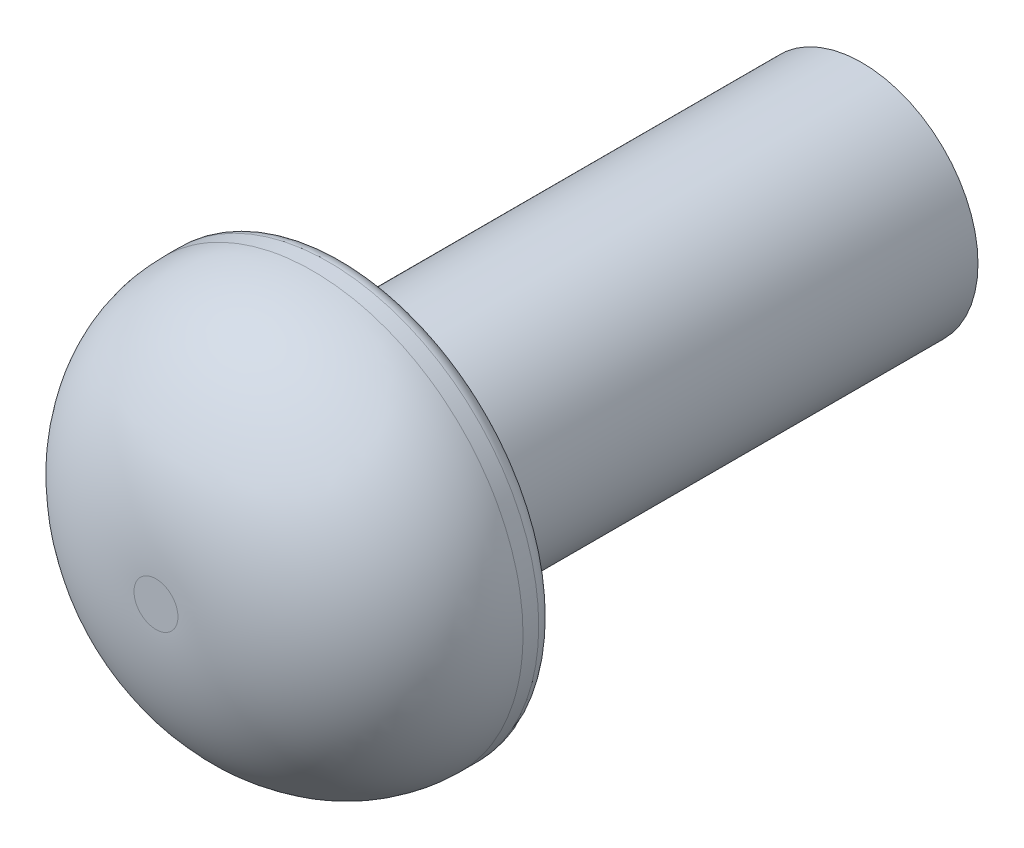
ISO-10303-21;
HEADER;
FILE_DESCRIPTION(('STEP AP214'),'2;1');
FILE_NAME('part.step','',(''),(''),'','','');
FILE_SCHEMA(('AUTOMOTIVE_DESIGN { 1 0 10303 214 1 1 1 1 }'));
ENDSEC;
DATA;
#1=APPLICATION_CONTEXT('core data for automotive mechanical design processes');
#2=APPLICATION_PROTOCOL_DEFINITION('international standard','automotive_design',2000,#1);
#3=PRODUCT_CONTEXT('',#1,'mechanical');
#4=PRODUCT('Part','Part','',(#3));
#5=PRODUCT_RELATED_PRODUCT_CATEGORY('part','',(#4));
#6=PRODUCT_DEFINITION_FORMATION('','',#4);
#7=PRODUCT_DEFINITION_CONTEXT('part definition',#1,'design');
#8=PRODUCT_DEFINITION('design','',#6,#7);
#9=PRODUCT_DEFINITION_SHAPE('','',#8);
#10=(LENGTH_UNIT() NAMED_UNIT(*) SI_UNIT(.MILLI.,.METRE.));
#11=(NAMED_UNIT(*) PLANE_ANGLE_UNIT() SI_UNIT($,.RADIAN.));
#12=(NAMED_UNIT(*) SI_UNIT($,.STERADIAN.) SOLID_ANGLE_UNIT());
#13=UNCERTAINTY_MEASURE_WITH_UNIT(LENGTH_MEASURE(1.E-05),#10,'distance_accuracy_value','');
#14=(GEOMETRIC_REPRESENTATION_CONTEXT(3) GLOBAL_UNCERTAINTY_ASSIGNED_CONTEXT((#13)) GLOBAL_UNIT_ASSIGNED_CONTEXT((#10,
#11,#12)) REPRESENTATION_CONTEXT('',''));
#15=CARTESIAN_POINT('',(0.,0.,0.));
#16=DIRECTION('',(0.,0.,1.));
#17=DIRECTION('',(1.,0.,0.));
#18=AXIS2_PLACEMENT_3D('',#15,#16,#17);
#19=CARTESIAN_POINT('',(0.,325.,-14.9303607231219));
#20=DIRECTION('',(0.,0.,1.));
#21=DIRECTION('',(1.,0.,0.));
#22=AXIS2_PLACEMENT_3D('',#19,#20,#21);
#23=CYLINDRICAL_SURFACE('',#22,7.40000000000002);
#24=CARTESIAN_POINT('',(0.,325.,6.));
#25=DIRECTION('',(0.,0.,1.));
#26=DIRECTION('',(1.,0.,0.));
#27=AXIS2_PLACEMENT_3D('',#24,#25,#26);
#28=CIRCLE('',#27,7.40000000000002);
#29=CARTESIAN_POINT('',(7.40000000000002,325.,6.));
#30=VERTEX_POINT('',#29);
#31=EDGE_CURVE('E139',#30,#30,#28,.F.);
#32=ORIENTED_EDGE('',*,*,#31,.F.);
#33=EDGE_LOOP('',(#32));
#34=FACE_BOUND('',#33,.T.);
#35=CARTESIAN_POINT('',(0.,325.,39.));
#36=DIRECTION('',(0.,0.,1.));
#37=DIRECTION('',(1.,0.,0.));
#38=AXIS2_PLACEMENT_3D('',#35,#36,#37);
#39=CIRCLE('',#38,7.40000000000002);
#40=CARTESIAN_POINT('',(7.40000000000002,325.,39.));
#41=VERTEX_POINT('',#40);
#42=EDGE_CURVE('E140',#41,#41,#39,.T.);
#43=ORIENTED_EDGE('',*,*,#42,.F.);
#44=EDGE_LOOP('',(#43));
#45=FACE_BOUND('',#44,.T.);
#46=ADVANCED_FACE('F42',(#34,#45),#23,.T.);
#47=CARTESIAN_POINT('',(0.,325.,6.));
#48=DIRECTION('',(0.,0.,1.));
#49=DIRECTION('',(1.,0.,0.));
#50=AXIS2_PLACEMENT_3D('',#47,#48,#49);
#51=PLANE('',#50);
#52=ORIENTED_EDGE('',*,*,#31,.T.);
#53=EDGE_LOOP('',(#52));
#54=FACE_BOUND('',#53,.T.);
#55=ADVANCED_FACE('F129',(#54),#51,.F.);
#56=CARTESIAN_POINT('',(0.,325.,51.));
#57=DIRECTION('',(0.,0.,-1.));
#58=DIRECTION('',(-1.,0.,0.));
#59=AXIS2_PLACEMENT_3D('',#56,#57,#58);
#60=CYLINDRICAL_SURFACE('',#59,13.4);
#61=CARTESIAN_POINT('',(0.,325.,40.));
#62=DIRECTION('',(0.,0.,1.));
#63=DIRECTION('',(1.,0.,0.));
#64=AXIS2_PLACEMENT_3D('',#61,#62,#63);
#65=CIRCLE('',#64,13.4);
#66=CARTESIAN_POINT('',(13.4,325.,40.));
#67=VERTEX_POINT('',#66);
#68=EDGE_CURVE('E48',#67,#67,#65,.T.);
#69=ORIENTED_EDGE('',*,*,#68,.T.);
#70=EDGE_LOOP('',(#69));
#71=FACE_BOUND('',#70,.T.);
#72=CARTESIAN_POINT('',(13.4,325.,41.));
#73=CARTESIAN_POINT('',(13.4,326.754055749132,41.));
#74=CARTESIAN_POINT('',(13.0512338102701,328.507421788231,41.));
#75=CARTESIAN_POINT('',(11.7087376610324,331.748494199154,41.));
#76=CARTESIAN_POINT('',(10.7155355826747,333.234926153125,41.));
#77=CARTESIAN_POINT('',(8.23492615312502,335.715535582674,41.));
#78=CARTESIAN_POINT('',(6.74849419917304,336.708737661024,41.));
#79=CARTESIAN_POINT('',(3.50742178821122,338.051233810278,41.));
#80=CARTESIAN_POINT('',(1.75405574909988,338.4,41.));
#81=CARTESIAN_POINT('',(-1.75405574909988,338.4,41.));
#82=CARTESIAN_POINT('',(-3.5074217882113,338.051233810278,41.));
#83=CARTESIAN_POINT('',(-6.74849419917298,336.708737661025,41.));
#84=CARTESIAN_POINT('',(-8.23492615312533,335.715535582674,41.));
#85=CARTESIAN_POINT('',(-10.7155355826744,333.234926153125,41.));
#86=CARTESIAN_POINT('',(-11.7087376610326,331.748494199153,41.));
#87=CARTESIAN_POINT('',(-13.0512338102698,328.507421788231,41.));
#88=CARTESIAN_POINT('',(-13.4,326.754055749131,41.));
#89=CARTESIAN_POINT('',(-13.4,323.245944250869,41.));
#90=CARTESIAN_POINT('',(-13.0512338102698,321.492578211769,41.));
#91=CARTESIAN_POINT('',(-11.7087376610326,318.251505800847,41.));
#92=CARTESIAN_POINT('',(-10.7155355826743,316.765073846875,41.));
#93=CARTESIAN_POINT('',(-8.23492615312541,314.284464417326,41.));
#94=CARTESIAN_POINT('',(-6.74849419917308,313.291262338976,41.));
#95=CARTESIAN_POINT('',(-3.50742178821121,311.948766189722,41.));
#96=CARTESIAN_POINT('',(-1.75405574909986,311.6,41.));
#97=CARTESIAN_POINT('',(1.7540557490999,311.6,41.));
#98=CARTESIAN_POINT('',(3.50742178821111,311.948766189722,41.));
#99=CARTESIAN_POINT('',(6.74849419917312,313.291262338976,41.));
#100=CARTESIAN_POINT('',(8.23492615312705,314.284464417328,41.));
#101=CARTESIAN_POINT('',(10.7155355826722,316.765073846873,41.));
#102=CARTESIAN_POINT('',(11.7087376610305,318.251505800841,41.));
#103=CARTESIAN_POINT('',(13.051233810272,321.492578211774,41.));
#104=CARTESIAN_POINT('',(13.4,323.245944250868,41.));
#105=CARTESIAN_POINT('',(13.4,325.,41.));
#106=(BOUNDED_CURVE() B_SPLINE_CURVE(3,(#72,#73,#74,#75,#76,#77,#78,#79,#80,#81,#82,#83,#84,#85,
#86,#87,#88,#89,#90,#91,#92,#93,#94,#95,#96,#97,#98,#99,#100,#101,#102,#103,#104,#105),
.UNSPECIFIED.,.T.,.F.) B_SPLINE_CURVE_WITH_KNOTS((4,2,2,2,2,2,2,2,2,2,2,2,2,2,2,2,4),(0.,
0.392699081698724,0.785398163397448,1.17809724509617,1.5707963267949,1.96349540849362,
2.35619449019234,2.74889357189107,3.14159265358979,3.53429173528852,3.92699081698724,
4.31968989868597,4.71238898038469,5.10508806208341,5.49778714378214,5.89048622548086,
6.28318530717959),
.UNSPECIFIED.) CURVE() GEOMETRIC_REPRESENTATION_ITEM() RATIONAL_B_SPLINE_CURVE((1.,1.,1.,1.,1.,
1.,1.,1.,1.,1.,1.,1.,1.,1.,1.,1.,1.,1.,1.,1.,1.,1.,1.,1.,1.,1.,1.,1.,1.,1.,1.,1.,1.,1.)) REPRESENTATION_ITEM(''));
#107=CARTESIAN_POINT('',(13.4,325.,41.));
#108=VERTEX_POINT('',#107);
#109=EDGE_CURVE('E52',#108,#108,#106,.F.);
#110=ORIENTED_EDGE('',*,*,#109,.T.);
#111=EDGE_LOOP('',(#110));
#112=FACE_BOUND('',#111,.T.);
#113=ADVANCED_FACE('F119',(#71,#112),#60,.T.);
#114=CARTESIAN_POINT('',(0.,325.,51.));
#115=DIRECTION('',(0.,0.,1.));
#116=DIRECTION('',(1.,0.,0.));
#117=AXIS2_PLACEMENT_3D('',#114,#115,#116);
#118=PLANE('',#117);
#119=CARTESIAN_POINT('',(1.40000000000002,325.,51.));
#120=CARTESIAN_POINT('',(1.40000000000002,324.81674044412,51.));
#121=CARTESIAN_POINT('',(1.3635617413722,324.633552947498,51.));
#122=CARTESIAN_POINT('',(1.22330094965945,324.29493344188,51.));
#123=CARTESIAN_POINT('',(1.11953356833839,324.139634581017,51.));
#124=CARTESIAN_POINT('',(0.860365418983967,323.88046643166,51.));
#125=CARTESIAN_POINT('',(0.705066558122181,323.776699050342,51.));
#126=CARTESIAN_POINT('',(0.366447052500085,323.636438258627,51.));
#127=CARTESIAN_POINT('',(0.183259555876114,323.6,51.));
#128=CARTESIAN_POINT('',(-0.183259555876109,323.6,51.));
#129=CARTESIAN_POINT('',(-0.366447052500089,323.636438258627,51.));
#130=CARTESIAN_POINT('',(-0.705066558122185,323.776699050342,51.));
#131=CARTESIAN_POINT('',(-0.86036541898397,323.88046643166,51.));
#132=CARTESIAN_POINT('',(-1.1195335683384,324.139634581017,51.));
#133=CARTESIAN_POINT('',(-1.22330094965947,324.29493344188,51.));
#134=CARTESIAN_POINT('',(-1.36356174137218,324.633552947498,51.));
#135=CARTESIAN_POINT('',(-1.40000000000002,324.81674044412,51.));
#136=CARTESIAN_POINT('',(-1.40000000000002,325.18325955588,51.));
#137=CARTESIAN_POINT('',(-1.36356174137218,325.366447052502,51.));
#138=CARTESIAN_POINT('',(-1.22330094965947,325.70506655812,51.));
#139=CARTESIAN_POINT('',(-1.11953356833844,325.860365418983,51.));
#140=CARTESIAN_POINT('',(-0.860365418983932,326.11953356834,51.));
#141=CARTESIAN_POINT('',(-0.705066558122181,326.223300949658,51.));
#142=CARTESIAN_POINT('',(-0.366447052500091,326.363561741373,51.));
#143=CARTESIAN_POINT('',(-0.183259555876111,326.4,51.));
#144=CARTESIAN_POINT('',(0.183259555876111,326.4,51.));
#145=CARTESIAN_POINT('',(0.366447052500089,326.363561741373,51.));
#146=CARTESIAN_POINT('',(0.70506655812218,326.223300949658,51.));
#147=CARTESIAN_POINT('',(0.860365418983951,326.11953356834,51.));
#148=CARTESIAN_POINT('',(1.11953356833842,325.860365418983,51.));
#149=CARTESIAN_POINT('',(1.22330094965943,325.70506655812,51.));
#150=CARTESIAN_POINT('',(1.36356174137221,325.366447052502,51.));
#151=CARTESIAN_POINT('',(1.40000000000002,325.18325955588,51.));
#152=CARTESIAN_POINT('',(1.40000000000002,325.,51.));
#153=(BOUNDED_CURVE() B_SPLINE_CURVE(3,(#119,#120,#121,#122,#123,#124,#125,#126,#127,#128,#129,
#130,#131,#132,#133,#134,#135,#136,#137,#138,#139,#140,#141,#142,#143,#144,#145,#146,#147,#148,
#149,#150,#151,#152),.UNSPECIFIED.,.T.,.F.) B_SPLINE_CURVE_WITH_KNOTS((4,2,2,2,2,2,2,2,2,2,2,2,
2,2,2,2,4),(0.,0.392699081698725,0.785398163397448,1.17809724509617,1.5707963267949,
1.96349540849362,2.35619449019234,2.74889357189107,3.14159265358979,3.53429173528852,
3.92699081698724,4.31968989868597,4.71238898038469,5.10508806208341,5.49778714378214,
5.89048622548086,6.28318530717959),
.UNSPECIFIED.) CURVE() GEOMETRIC_REPRESENTATION_ITEM() RATIONAL_B_SPLINE_CURVE((1.,1.,1.,1.,1.,
1.,1.,1.,1.,1.,1.,1.,1.,1.,1.,1.,1.,1.,1.,1.,1.,1.,1.,1.,1.,1.,1.,1.,1.,1.,1.,1.,1.,1.)) REPRESENTATION_ITEM(''));
#154=CARTESIAN_POINT('',(1.40000000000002,325.,51.));
#155=VERTEX_POINT('',#154);
#156=EDGE_CURVE('E56',#155,#155,#153,.F.);
#157=ORIENTED_EDGE('',*,*,#156,.T.);
#158=EDGE_LOOP('',(#157));
#159=FACE_BOUND('',#158,.T.);
#160=ADVANCED_FACE('F128',(#159),#118,.T.);
#161=CARTESIAN_POINT('',(0.,325.,39.));
#162=DIRECTION('',(0.,0.,1.));
#163=DIRECTION('',(1.,0.,0.));
#164=AXIS2_PLACEMENT_3D('',#161,#162,#163);
#165=PLANE('',#164);
#166=CARTESIAN_POINT('',(0.,325.,39.));
#167=DIRECTION('',(0.,0.,1.));
#168=DIRECTION('',(1.,0.,0.));
#169=AXIS2_PLACEMENT_3D('',#166,#167,#168);
#170=CIRCLE('',#169,12.4);
#171=CARTESIAN_POINT('',(12.4,325.,39.));
#172=VERTEX_POINT('',#171);
#173=EDGE_CURVE('E11',#172,#172,#170,.F.);
#174=ORIENTED_EDGE('',*,*,#173,.T.);
#175=EDGE_LOOP('',(#174));
#176=FACE_BOUND('',#175,.T.);
#177=ORIENTED_EDGE('',*,*,#42,.T.);
#178=EDGE_LOOP('',(#177));
#179=FACE_BOUND('',#178,.T.);
#180=ADVANCED_FACE('F77',(#176,#179),#165,.F.);
#181=CARTESIAN_POINT('',(1.40000000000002,325.,51.));
#182=CARTESIAN_POINT('',(1.40000000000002,325.18325955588,51.));
#183=CARTESIAN_POINT('',(1.36356174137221,325.366447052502,51.));
#184=CARTESIAN_POINT('',(1.22330094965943,325.70506655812,51.));
#185=CARTESIAN_POINT('',(1.11953356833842,325.860365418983,51.));
#186=CARTESIAN_POINT('',(0.860365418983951,326.11953356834,51.));
#187=CARTESIAN_POINT('',(0.70506655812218,326.223300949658,51.));
#188=CARTESIAN_POINT('',(0.366447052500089,326.363561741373,51.));
#189=CARTESIAN_POINT('',(0.183259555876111,326.4,51.));
#190=CARTESIAN_POINT('',(-0.183259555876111,326.4,51.));
#191=CARTESIAN_POINT('',(-0.366447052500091,326.363561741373,51.));
#192=CARTESIAN_POINT('',(-0.705066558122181,326.223300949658,51.));
#193=CARTESIAN_POINT('',(-0.860365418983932,326.11953356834,51.));
#194=CARTESIAN_POINT('',(-1.11953356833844,325.860365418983,51.));
#195=CARTESIAN_POINT('',(-1.22330094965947,325.70506655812,51.));
#196=CARTESIAN_POINT('',(-1.36356174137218,325.366447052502,51.));
#197=CARTESIAN_POINT('',(-1.40000000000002,325.18325955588,51.));
#198=CARTESIAN_POINT('',(-1.40000000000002,324.81674044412,51.));
#199=CARTESIAN_POINT('',(-1.36356174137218,324.633552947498,51.));
#200=CARTESIAN_POINT('',(-1.22330094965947,324.29493344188,51.));
#201=CARTESIAN_POINT('',(-1.1195335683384,324.139634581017,51.));
#202=CARTESIAN_POINT('',(-0.86036541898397,323.88046643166,51.));
#203=CARTESIAN_POINT('',(-0.705066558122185,323.776699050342,51.));
#204=CARTESIAN_POINT('',(-0.366447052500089,323.636438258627,51.));
#205=CARTESIAN_POINT('',(-0.183259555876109,323.6,51.));
#206=CARTESIAN_POINT('',(0.183259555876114,323.6,51.));
#207=CARTESIAN_POINT('',(0.366447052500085,323.636438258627,51.));
#208=CARTESIAN_POINT('',(0.705066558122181,323.776699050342,51.));
#209=CARTESIAN_POINT('',(0.860365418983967,323.88046643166,51.));
#210=CARTESIAN_POINT('',(1.11953356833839,324.139634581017,51.));
#211=CARTESIAN_POINT('',(1.22330094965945,324.29493344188,51.));
#212=CARTESIAN_POINT('',(1.3635617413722,324.633552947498,51.));
#213=CARTESIAN_POINT('',(1.40000000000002,324.81674044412,51.));
#214=CARTESIAN_POINT('',(1.40000000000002,325.,51.));
#215=CARTESIAN_POINT('',(13.4,325.,51.));
#216=CARTESIAN_POINT('',(13.4000000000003,326.754055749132,51.0000000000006));
#217=CARTESIAN_POINT('',(13.0512338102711,328.507421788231,51.));
#218=CARTESIAN_POINT('',(11.7087376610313,331.748494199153,51.));
#219=CARTESIAN_POINT('',(10.7155355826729,333.234926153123,51.));
#220=CARTESIAN_POINT('',(8.23492615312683,335.715535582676,51.));
#221=CARTESIAN_POINT('',(6.74849419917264,336.708737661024,51.));
#222=CARTESIAN_POINT('',(3.50742178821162,338.051233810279,51.));
#223=CARTESIAN_POINT('',(1.75405574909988,338.4,51.));
#224=CARTESIAN_POINT('',(-1.75405574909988,338.4,51.));
#225=CARTESIAN_POINT('',(-3.50742178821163,338.051233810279,51.));
#226=CARTESIAN_POINT('',(-6.74849419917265,336.708737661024,51.));
#227=CARTESIAN_POINT('',(-8.23492615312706,335.715535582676,51.));
#228=CARTESIAN_POINT('',(-10.7155355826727,333.234926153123,51.));
#229=CARTESIAN_POINT('',(-11.7087376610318,331.748494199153,51.));
#230=CARTESIAN_POINT('',(-13.0512338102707,328.507421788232,51.));
#231=CARTESIAN_POINT('',(-13.4,326.754055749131,51.));
#232=CARTESIAN_POINT('',(-13.4,323.245944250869,51.));
#233=CARTESIAN_POINT('',(-13.0512338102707,321.492578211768,51.));
#234=CARTESIAN_POINT('',(-11.7087376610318,318.251505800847,51.));
#235=CARTESIAN_POINT('',(-10.7155355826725,316.765073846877,51.));
#236=CARTESIAN_POINT('',(-8.23492615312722,314.284464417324,51.));
#237=CARTESIAN_POINT('',(-6.74849419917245,313.291262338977,51.));
#238=CARTESIAN_POINT('',(-3.50742178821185,311.948766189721,51.));
#239=CARTESIAN_POINT('',(-1.75405574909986,311.6,51.));
#240=CARTESIAN_POINT('',(1.7540557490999,311.6,51.));
#241=CARTESIAN_POINT('',(3.50742178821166,311.948766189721,51.));
#242=CARTESIAN_POINT('',(6.74849419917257,313.291262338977,51.));
#243=CARTESIAN_POINT('',(8.23492615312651,314.284464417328,51.));
#244=CARTESIAN_POINT('',(10.7155355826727,316.765073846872,51.));
#245=CARTESIAN_POINT('',(11.7087376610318,318.251505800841,51.));
#246=CARTESIAN_POINT('',(13.0512338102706,321.492578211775,51.));
#247=CARTESIAN_POINT('',(13.3999999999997,323.245944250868,50.9999999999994));
#248=CARTESIAN_POINT('',(13.4,325.,51.));
#249=CARTESIAN_POINT('',(13.4,325.,41.));
#250=CARTESIAN_POINT('',(13.4,326.754055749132,41.));
#251=CARTESIAN_POINT('',(13.0512338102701,328.507421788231,41.));
#252=CARTESIAN_POINT('',(11.7087376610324,331.748494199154,41.));
#253=CARTESIAN_POINT('',(10.7155355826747,333.234926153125,41.));
#254=CARTESIAN_POINT('',(8.23492615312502,335.715535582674,41.));
#255=CARTESIAN_POINT('',(6.74849419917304,336.708737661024,41.));
#256=CARTESIAN_POINT('',(3.50742178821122,338.051233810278,41.));
#257=CARTESIAN_POINT('',(1.75405574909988,338.4,41.));
#258=CARTESIAN_POINT('',(-1.75405574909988,338.4,41.));
#259=CARTESIAN_POINT('',(-3.5074217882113,338.051233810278,41.));
#260=CARTESIAN_POINT('',(-6.74849419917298,336.708737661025,41.));
#261=CARTESIAN_POINT('',(-8.23492615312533,335.715535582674,41.));
#262=CARTESIAN_POINT('',(-10.7155355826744,333.234926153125,41.));
#263=CARTESIAN_POINT('',(-11.7087376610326,331.748494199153,41.));
#264=CARTESIAN_POINT('',(-13.0512338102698,328.507421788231,41.));
#265=CARTESIAN_POINT('',(-13.4,326.754055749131,41.));
#266=CARTESIAN_POINT('',(-13.4,323.245944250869,41.));
#267=CARTESIAN_POINT('',(-13.0512338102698,321.492578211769,41.));
#268=CARTESIAN_POINT('',(-11.7087376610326,318.251505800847,41.));
#269=CARTESIAN_POINT('',(-10.7155355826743,316.765073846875,41.));
#270=CARTESIAN_POINT('',(-8.23492615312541,314.284464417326,41.));
#271=CARTESIAN_POINT('',(-6.74849419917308,313.291262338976,41.));
#272=CARTESIAN_POINT('',(-3.50742178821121,311.948766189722,41.));
#273=CARTESIAN_POINT('',(-1.75405574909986,311.6,41.));
#274=CARTESIAN_POINT('',(1.7540557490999,311.6,41.));
#275=CARTESIAN_POINT('',(3.50742178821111,311.948766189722,41.));
#276=CARTESIAN_POINT('',(6.74849419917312,313.291262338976,41.));
#277=CARTESIAN_POINT('',(8.23492615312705,314.284464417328,41.));
#278=CARTESIAN_POINT('',(10.7155355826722,316.765073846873,41.));
#279=CARTESIAN_POINT('',(11.7087376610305,318.251505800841,41.));
#280=CARTESIAN_POINT('',(13.051233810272,321.492578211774,41.));
#281=CARTESIAN_POINT('',(13.4,323.245944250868,41.));
#282=CARTESIAN_POINT('',(13.4,325.,41.));
#283=(BOUNDED_SURFACE() B_SPLINE_SURFACE(2,3,((#181,#182,#183,#184,#185,#186,#187,#188,#189,
#190,#191,#192,#193,#194,#195,#196,#197,#198,#199,#200,#201,#202,#203,#204,#205,#206,#207,#208,
#209,#210,#211,#212,#213,#214),(#215,#216,#217,#218,#219,#220,#221,#222,#223,#224,#225,#226,
#227,#228,#229,#230,#231,#232,#233,#234,#235,#236,#237,#238,#239,#240,#241,#242,#243,#244,#245,
#246,#247,#248),(#249,#250,#251,#252,#253,#254,#255,#256,#257,#258,#259,#260,#261,#262,#263,
#264,#265,#266,#267,#268,#269,#270,#271,#272,#273,#274,#275,#276,#277,#278,#279,#280,#281,
#282)),.UNSPECIFIED.,.F.,.T.,.F.) B_SPLINE_SURFACE_WITH_KNOTS((3,3),(4,2,2,2,2,2,2,2,2,2,2,2,2,
2,2,2,4),(0.,1.),(0.,0.392699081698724,0.785398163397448,1.17809724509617,1.5707963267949,
1.96349540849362,2.35619449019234,2.74889357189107,3.14159265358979,3.53429173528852,
3.92699081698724,4.31968989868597,4.71238898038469,5.10508806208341,5.49778714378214,
5.89048622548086,6.28318530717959),
.UNSPECIFIED.) GEOMETRIC_REPRESENTATION_ITEM() RATIONAL_B_SPLINE_SURFACE(((1.,1.,1.,1.,1.,1.,1.,
1.,1.,1.,1.,1.,1.,1.,1.,1.,1.,1.,1.,1.,1.,1.,1.,1.,1.,1.,1.,1.,1.,1.,1.,1.,1.,1.),
(0.707106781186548,0.707106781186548,0.707106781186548,0.707106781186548,0.707106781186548,
0.707106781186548,0.707106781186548,0.707106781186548,0.707106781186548,0.707106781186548,
0.707106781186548,0.707106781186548,0.707106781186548,0.707106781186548,0.707106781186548,
0.707106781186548,0.707106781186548,0.707106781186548,0.707106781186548,0.707106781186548,
0.707106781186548,0.707106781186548,0.707106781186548,0.707106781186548,0.707106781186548,
0.707106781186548,0.707106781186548,0.707106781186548,0.707106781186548,0.707106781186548,
0.707106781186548,0.707106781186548,0.707106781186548,0.707106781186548),(1.,1.,1.,1.,1.,1.,1.,
1.,1.,1.,1.,1.,1.,1.,1.,1.,1.,1.,1.,1.,1.,1.,1.,1.,1.,1.,1.,1.,1.,1.,1.,1.,1.,1.))) REPRESENTATION_ITEM('') SURFACE());
#284=ORIENTED_EDGE('',*,*,#109,.F.);
#285=EDGE_LOOP('',(#284));
#286=FACE_BOUND('',#285,.T.);
#287=ORIENTED_EDGE('',*,*,#156,.F.);
#288=EDGE_LOOP('',(#287));
#289=FACE_BOUND('',#288,.T.);
#290=ADVANCED_FACE('F64',(#286,#289),#283,.T.);
#291=CARTESIAN_POINT('',(0.,325.,40.));
#292=DIRECTION('',(0.,0.,1.));
#293=DIRECTION('',(1.,0.,0.));
#294=AXIS2_PLACEMENT_3D('',#291,#292,#293);
#295=TOROIDAL_SURFACE('',#294,12.4,1.);
#296=ORIENTED_EDGE('',*,*,#173,.F.);
#297=EDGE_LOOP('',(#296));
#298=FACE_BOUND('',#297,.T.);
#299=ORIENTED_EDGE('',*,*,#68,.F.);
#300=EDGE_LOOP('',(#299));
#301=FACE_BOUND('',#300,.T.);
#302=ADVANCED_FACE('F44',(#298,#301),#295,.T.);
#303=CLOSED_SHELL('',(#46,#55,#113,#160,#180,#290,#302));
#304=MANIFOLD_SOLID_BREP('B2',#303);
#305=ADVANCED_BREP_SHAPE_REPRESENTATION('',(#18,#304),#14);
#306=SHAPE_DEFINITION_REPRESENTATION(#9,#305);
ENDSEC;
END-ISO-10303-21;
